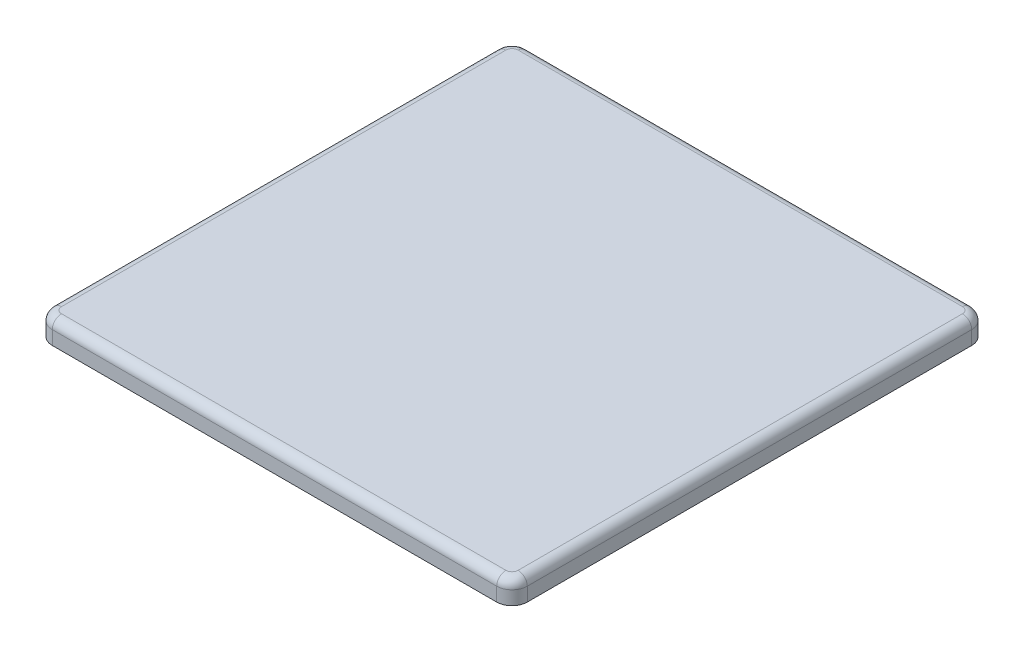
ISO-10303-21;
HEADER;
FILE_DESCRIPTION(('STEP AP214'),'2;1');
FILE_NAME('part.step','',(''),(''),'','','');
FILE_SCHEMA(('AUTOMOTIVE_DESIGN { 1 0 10303 214 1 1 1 1 }'));
ENDSEC;
DATA;
#1=APPLICATION_CONTEXT('core data for automotive mechanical design processes');
#2=APPLICATION_PROTOCOL_DEFINITION('international standard','automotive_design',2000,#1);
#3=PRODUCT_CONTEXT('',#1,'mechanical');
#4=PRODUCT('Part','Part','',(#3));
#5=PRODUCT_RELATED_PRODUCT_CATEGORY('part','',(#4));
#6=PRODUCT_DEFINITION_FORMATION('','',#4);
#7=PRODUCT_DEFINITION_CONTEXT('part definition',#1,'design');
#8=PRODUCT_DEFINITION('design','',#6,#7);
#9=PRODUCT_DEFINITION_SHAPE('','',#8);
#10=(LENGTH_UNIT() NAMED_UNIT(*) SI_UNIT(.MILLI.,.METRE.));
#11=(NAMED_UNIT(*) PLANE_ANGLE_UNIT() SI_UNIT($,.RADIAN.));
#12=(NAMED_UNIT(*) SI_UNIT($,.STERADIAN.) SOLID_ANGLE_UNIT());
#13=UNCERTAINTY_MEASURE_WITH_UNIT(LENGTH_MEASURE(1.E-05),#10,'distance_accuracy_value','');
#14=(GEOMETRIC_REPRESENTATION_CONTEXT(3) GLOBAL_UNCERTAINTY_ASSIGNED_CONTEXT((#13)) GLOBAL_UNIT_ASSIGNED_CONTEXT((#10,
#11,#12)) REPRESENTATION_CONTEXT('',''));
#15=CARTESIAN_POINT('',(0.,0.,0.));
#16=DIRECTION('',(0.,0.,1.));
#17=DIRECTION('',(1.,0.,0.));
#18=AXIS2_PLACEMENT_3D('',#15,#16,#17);
#19=CARTESIAN_POINT('',(-15.525,1.5,15.525));
#20=DIRECTION('',(1.,0.,0.));
#21=DIRECTION('',(0.,0.,-1.));
#22=AXIS2_PLACEMENT_3D('',#19,#20,#21);
#23=PLANE('',#22);
#24=DIRECTION('',(0.,-1.,0.));
#25=VECTOR('',#24,1.);
#26=CARTESIAN_POINT('',(-15.525,1.5,14.525));
#27=LINE('',#26,#25);
#28=CARTESIAN_POINT('',(-15.525,0.,14.525));
#29=VERTEX_POINT('',#28);
#30=CARTESIAN_POINT('',(-15.525,0.9,14.525));
#31=VERTEX_POINT('',#30);
#32=EDGE_CURVE('E148',#29,#31,#27,.F.);
#33=ORIENTED_EDGE('',*,*,#32,.T.);
#34=DIRECTION('',(0.,0.,1.));
#35=VECTOR('',#34,1.);
#36=CARTESIAN_POINT('',(-15.525,0.9,-14.525));
#37=LINE('',#36,#35);
#38=CARTESIAN_POINT('',(-15.525,0.9,-14.525));
#39=VERTEX_POINT('',#38);
#40=EDGE_CURVE('E143',#31,#39,#37,.F.);
#41=ORIENTED_EDGE('',*,*,#40,.T.);
#42=DIRECTION('',(0.,-1.,0.));
#43=VECTOR('',#42,1.);
#44=CARTESIAN_POINT('',(-15.525,1.5,-14.525));
#45=LINE('',#44,#43);
#46=CARTESIAN_POINT('',(-15.525,0.,-14.525));
#47=VERTEX_POINT('',#46);
#48=EDGE_CURVE('E138',#39,#47,#45,.T.);
#49=ORIENTED_EDGE('',*,*,#48,.T.);
#50=DIRECTION('',(0.,0.,1.));
#51=VECTOR('',#50,1.);
#52=CARTESIAN_POINT('',(-15.525,0.,15.525));
#53=LINE('',#52,#51);
#54=EDGE_CURVE('E141',#47,#29,#53,.T.);
#55=ORIENTED_EDGE('',*,*,#54,.T.);
#56=EDGE_LOOP('',(#33,#41,#49,#55));
#57=FACE_BOUND('',#56,.T.);
#58=ADVANCED_FACE('F47',(#57),#23,.F.);
#59=CARTESIAN_POINT('',(15.525,1.5,15.525));
#60=DIRECTION('',(0.,0.,-1.));
#61=DIRECTION('',(-1.,0.,0.));
#62=AXIS2_PLACEMENT_3D('',#59,#60,#61);
#63=PLANE('',#62);
#64=DIRECTION('',(0.,-1.,0.));
#65=VECTOR('',#64,1.);
#66=CARTESIAN_POINT('',(14.525,1.5,15.525));
#67=LINE('',#66,#65);
#68=CARTESIAN_POINT('',(14.525,0.,15.525));
#69=VERTEX_POINT('',#68);
#70=CARTESIAN_POINT('',(14.525,0.9,15.525));
#71=VERTEX_POINT('',#70);
#72=EDGE_CURVE('E195',#69,#71,#67,.F.);
#73=ORIENTED_EDGE('',*,*,#72,.T.);
#74=DIRECTION('',(1.,0.,0.));
#75=VECTOR('',#74,1.);
#76=CARTESIAN_POINT('',(-14.525,0.9,15.525));
#77=LINE('',#76,#75);
#78=CARTESIAN_POINT('',(-14.525,0.9,15.525));
#79=VERTEX_POINT('',#78);
#80=EDGE_CURVE('E70',#71,#79,#77,.F.);
#81=ORIENTED_EDGE('',*,*,#80,.T.);
#82=DIRECTION('',(0.,-1.,0.));
#83=VECTOR('',#82,1.);
#84=CARTESIAN_POINT('',(-14.525,1.5,15.525));
#85=LINE('',#84,#83);
#86=CARTESIAN_POINT('',(-14.525,0.,15.525));
#87=VERTEX_POINT('',#86);
#88=EDGE_CURVE('E193',#79,#87,#85,.T.);
#89=ORIENTED_EDGE('',*,*,#88,.T.);
#90=DIRECTION('',(1.,0.,0.));
#91=VECTOR('',#90,1.);
#92=CARTESIAN_POINT('',(15.525,0.,15.525));
#93=LINE('',#92,#91);
#94=EDGE_CURVE('E164',#87,#69,#93,.T.);
#95=ORIENTED_EDGE('',*,*,#94,.T.);
#96=EDGE_LOOP('',(#73,#81,#89,#95));
#97=FACE_BOUND('',#96,.T.);
#98=ADVANCED_FACE('F301',(#97),#63,.F.);
#99=CARTESIAN_POINT('',(15.525,1.5,15.525));
#100=DIRECTION('',(-1.,0.,0.));
#101=DIRECTION('',(0.,0.,1.));
#102=AXIS2_PLACEMENT_3D('',#99,#100,#101);
#103=PLANE('',#102);
#104=DIRECTION('',(0.,-1.,0.));
#105=VECTOR('',#104,1.);
#106=CARTESIAN_POINT('',(15.525,1.5,-14.525));
#107=LINE('',#106,#105);
#108=CARTESIAN_POINT('',(15.525,0.,-14.525));
#109=VERTEX_POINT('',#108);
#110=CARTESIAN_POINT('',(15.525,0.9,-14.525));
#111=VERTEX_POINT('',#110);
#112=EDGE_CURVE('E190',#109,#111,#107,.F.);
#113=ORIENTED_EDGE('',*,*,#112,.T.);
#114=DIRECTION('',(0.,0.,-1.));
#115=VECTOR('',#114,1.);
#116=CARTESIAN_POINT('',(15.525,0.9,14.525));
#117=LINE('',#116,#115);
#118=CARTESIAN_POINT('',(15.525,0.9,14.525));
#119=VERTEX_POINT('',#118);
#120=EDGE_CURVE('E220',#111,#119,#117,.F.);
#121=ORIENTED_EDGE('',*,*,#120,.T.);
#122=DIRECTION('',(0.,-1.,0.));
#123=VECTOR('',#122,1.);
#124=CARTESIAN_POINT('',(15.525,1.5,14.525));
#125=LINE('',#124,#123);
#126=CARTESIAN_POINT('',(15.525,0.,14.525));
#127=VERTEX_POINT('',#126);
#128=EDGE_CURVE('E188',#119,#127,#125,.T.);
#129=ORIENTED_EDGE('',*,*,#128,.T.);
#130=DIRECTION('',(0.,0.,-1.));
#131=VECTOR('',#130,1.);
#132=CARTESIAN_POINT('',(15.525,0.,15.525));
#133=LINE('',#132,#131);
#134=EDGE_CURVE('E168',#127,#109,#133,.T.);
#135=ORIENTED_EDGE('',*,*,#134,.T.);
#136=EDGE_LOOP('',(#113,#121,#129,#135));
#137=FACE_BOUND('',#136,.T.);
#138=ADVANCED_FACE('F306',(#137),#103,.F.);
#139=CARTESIAN_POINT('',(15.525,1.5,-15.525));
#140=DIRECTION('',(0.,0.,1.));
#141=DIRECTION('',(1.,0.,0.));
#142=AXIS2_PLACEMENT_3D('',#139,#140,#141);
#143=PLANE('',#142);
#144=DIRECTION('',(0.,-1.,0.));
#145=VECTOR('',#144,1.);
#146=CARTESIAN_POINT('',(-14.525,1.5,-15.525));
#147=LINE('',#146,#145);
#148=CARTESIAN_POINT('',(-14.525,0.,-15.525));
#149=VERTEX_POINT('',#148);
#150=CARTESIAN_POINT('',(-14.525,0.9,-15.525));
#151=VERTEX_POINT('',#150);
#152=EDGE_CURVE('E154',#149,#151,#147,.F.);
#153=ORIENTED_EDGE('',*,*,#152,.T.);
#154=DIRECTION('',(-1.,0.,0.));
#155=VECTOR('',#154,1.);
#156=CARTESIAN_POINT('',(14.525,0.9,-15.525));
#157=LINE('',#156,#155);
#158=CARTESIAN_POINT('',(14.525,0.9,-15.525));
#159=VERTEX_POINT('',#158);
#160=EDGE_CURVE('E216',#151,#159,#157,.F.);
#161=ORIENTED_EDGE('',*,*,#160,.T.);
#162=DIRECTION('',(0.,-1.,0.));
#163=VECTOR('',#162,1.);
#164=CARTESIAN_POINT('',(14.525,1.5,-15.525));
#165=LINE('',#164,#163);
#166=CARTESIAN_POINT('',(14.525,0.,-15.525));
#167=VERTEX_POINT('',#166);
#168=EDGE_CURVE('E158',#159,#167,#165,.T.);
#169=ORIENTED_EDGE('',*,*,#168,.T.);
#170=DIRECTION('',(-1.,0.,0.));
#171=VECTOR('',#170,1.);
#172=CARTESIAN_POINT('',(15.525,0.,-15.525));
#173=LINE('',#172,#171);
#174=EDGE_CURVE('E179',#167,#149,#173,.T.);
#175=ORIENTED_EDGE('',*,*,#174,.T.);
#176=EDGE_LOOP('',(#153,#161,#169,#175));
#177=FACE_BOUND('',#176,.T.);
#178=ADVANCED_FACE('F387',(#177),#143,.F.);
#179=CARTESIAN_POINT('',(0.,1.5,0.));
#180=DIRECTION('',(0.,1.,0.));
#181=DIRECTION('',(0.,0.,1.));
#182=AXIS2_PLACEMENT_3D('',#179,#180,#181);
#183=PLANE('',#182);
#184=DIRECTION('',(-1.,0.,0.));
#185=VECTOR('',#184,1.);
#186=CARTESIAN_POINT('',(-14.525,1.5,-14.925));
#187=LINE('',#186,#185);
#188=CARTESIAN_POINT('',(14.525,1.5,-14.925));
#189=VERTEX_POINT('',#188);
#190=CARTESIAN_POINT('',(-14.525,1.5,-14.925));
#191=VERTEX_POINT('',#190);
#192=EDGE_CURVE('E209',#189,#191,#187,.T.);
#193=ORIENTED_EDGE('',*,*,#192,.T.);
#194=CARTESIAN_POINT('',(-14.525,1.5,-14.525));
#195=DIRECTION('',(0.,1.,0.));
#196=DIRECTION('',(0.,0.,1.));
#197=AXIS2_PLACEMENT_3D('',#194,#195,#196);
#198=CIRCLE('',#197,0.4);
#199=CARTESIAN_POINT('',(-14.925,1.5,-14.525));
#200=VERTEX_POINT('',#199);
#201=EDGE_CURVE('E211',#191,#200,#198,.T.);
#202=ORIENTED_EDGE('',*,*,#201,.T.);
#203=DIRECTION('',(0.,0.,1.));
#204=VECTOR('',#203,1.);
#205=CARTESIAN_POINT('',(-14.925,1.5,14.525));
#206=LINE('',#205,#204);
#207=CARTESIAN_POINT('',(-14.925,1.5,14.525));
#208=VERTEX_POINT('',#207);
#209=EDGE_CURVE('E197',#200,#208,#206,.T.);
#210=ORIENTED_EDGE('',*,*,#209,.T.);
#211=CARTESIAN_POINT('',(-14.525,1.5,14.525));
#212=DIRECTION('',(0.,1.,0.));
#213=DIRECTION('',(0.,0.,1.));
#214=AXIS2_PLACEMENT_3D('',#211,#212,#213);
#215=CIRCLE('',#214,0.4);
#216=CARTESIAN_POINT('',(-14.525,1.5,14.925));
#217=VERTEX_POINT('',#216);
#218=EDGE_CURVE('E199',#208,#217,#215,.T.);
#219=ORIENTED_EDGE('',*,*,#218,.T.);
#220=DIRECTION('',(1.,0.,0.));
#221=VECTOR('',#220,1.);
#222=CARTESIAN_POINT('',(14.525,1.5,14.925));
#223=LINE('',#222,#221);
#224=CARTESIAN_POINT('',(14.525,1.5,14.925));
#225=VERTEX_POINT('',#224);
#226=EDGE_CURVE('E201',#217,#225,#223,.T.);
#227=ORIENTED_EDGE('',*,*,#226,.T.);
#228=CARTESIAN_POINT('',(14.525,1.5,14.525));
#229=DIRECTION('',(0.,1.,0.));
#230=DIRECTION('',(0.,0.,1.));
#231=AXIS2_PLACEMENT_3D('',#228,#229,#230);
#232=CIRCLE('',#231,0.4);
#233=CARTESIAN_POINT('',(14.925,1.5,14.525));
#234=VERTEX_POINT('',#233);
#235=EDGE_CURVE('E203',#225,#234,#232,.T.);
#236=ORIENTED_EDGE('',*,*,#235,.T.);
#237=DIRECTION('',(0.,0.,-1.));
#238=VECTOR('',#237,1.);
#239=CARTESIAN_POINT('',(14.925,1.5,-14.525));
#240=LINE('',#239,#238);
#241=CARTESIAN_POINT('',(14.925,1.5,-14.525));
#242=VERTEX_POINT('',#241);
#243=EDGE_CURVE('E205',#234,#242,#240,.T.);
#244=ORIENTED_EDGE('',*,*,#243,.T.);
#245=CARTESIAN_POINT('',(14.525,1.5,-14.525));
#246=DIRECTION('',(0.,1.,0.));
#247=DIRECTION('',(0.,0.,1.));
#248=AXIS2_PLACEMENT_3D('',#245,#246,#247);
#249=CIRCLE('',#248,0.4);
#250=EDGE_CURVE('E207',#242,#189,#249,.T.);
#251=ORIENTED_EDGE('',*,*,#250,.T.);
#252=EDGE_LOOP('',(#193,#202,#210,#219,#227,#236,#244,#251));
#253=FACE_BOUND('',#252,.T.);
#254=ADVANCED_FACE('F384',(#253),#183,.T.);
#255=CARTESIAN_POINT('',(0.,0.,0.));
#256=DIRECTION('',(0.,1.,0.));
#257=DIRECTION('',(0.,0.,1.));
#258=AXIS2_PLACEMENT_3D('',#255,#256,#257);
#259=PLANE('',#258);
#260=CARTESIAN_POINT('',(-7.525,0.,-9.02500000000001));
#261=DIRECTION('',(0.,1.,0.));
#262=DIRECTION('',(0.,0.,1.));
#263=AXIS2_PLACEMENT_3D('',#260,#261,#262);
#264=CIRCLE('',#263,3.95393920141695);
#265=CARTESIAN_POINT('',(-7.525,0.,-5.07106079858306));
#266=VERTEX_POINT('',#265);
#267=EDGE_CURVE('E11',#266,#266,#264,.T.);
#268=ORIENTED_EDGE('',*,*,#267,.T.);
#269=EDGE_LOOP('',(#268));
#270=FACE_BOUND('',#269,.T.);
#271=CARTESIAN_POINT('',(7.525,0.,-9.02500000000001));
#272=DIRECTION('',(0.,1.,0.));
#273=DIRECTION('',(0.,0.,1.));
#274=AXIS2_PLACEMENT_3D('',#271,#272,#273);
#275=CIRCLE('',#274,3.95393920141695);
#276=CARTESIAN_POINT('',(7.525,0.,-5.07106079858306));
#277=VERTEX_POINT('',#276);
#278=EDGE_CURVE('E55',#277,#277,#275,.T.);
#279=ORIENTED_EDGE('',*,*,#278,.T.);
#280=EDGE_LOOP('',(#279));
#281=FACE_BOUND('',#280,.T.);
#282=CARTESIAN_POINT('',(7.525,0.,0.));
#283=DIRECTION('',(0.,1.,0.));
#284=DIRECTION('',(0.,0.,1.));
#285=AXIS2_PLACEMENT_3D('',#282,#283,#284);
#286=CIRCLE('',#285,3.95393920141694);
#287=CARTESIAN_POINT('',(7.525,0.,3.95393920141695));
#288=VERTEX_POINT('',#287);
#289=EDGE_CURVE('E254',#288,#288,#286,.T.);
#290=ORIENTED_EDGE('',*,*,#289,.T.);
#291=EDGE_LOOP('',(#290));
#292=FACE_BOUND('',#291,.T.);
#293=CARTESIAN_POINT('',(7.525,0.,9.02500000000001));
#294=DIRECTION('',(0.,1.,0.));
#295=DIRECTION('',(0.,0.,1.));
#296=AXIS2_PLACEMENT_3D('',#293,#294,#295);
#297=CIRCLE('',#296,3.95393920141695);
#298=CARTESIAN_POINT('',(7.525,0.,12.978939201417));
#299=VERTEX_POINT('',#298);
#300=EDGE_CURVE('E251',#299,#299,#297,.T.);
#301=ORIENTED_EDGE('',*,*,#300,.T.);
#302=EDGE_LOOP('',(#301));
#303=FACE_BOUND('',#302,.T.);
#304=CARTESIAN_POINT('',(-7.525,0.,0.));
#305=DIRECTION('',(0.,1.,0.));
#306=DIRECTION('',(0.,0.,1.));
#307=AXIS2_PLACEMENT_3D('',#304,#305,#306);
#308=CIRCLE('',#307,3.95393920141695);
#309=CARTESIAN_POINT('',(-7.525,0.,3.95393920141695));
#310=VERTEX_POINT('',#309);
#311=EDGE_CURVE('E248',#310,#310,#308,.T.);
#312=ORIENTED_EDGE('',*,*,#311,.T.);
#313=EDGE_LOOP('',(#312));
#314=FACE_BOUND('',#313,.T.);
#315=CARTESIAN_POINT('',(-7.525,0.,9.02500000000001));
#316=DIRECTION('',(0.,1.,0.));
#317=DIRECTION('',(0.,0.,1.));
#318=AXIS2_PLACEMENT_3D('',#315,#316,#317);
#319=CIRCLE('',#318,3.95393920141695);
#320=CARTESIAN_POINT('',(-7.525,0.,12.978939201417));
#321=VERTEX_POINT('',#320);
#322=EDGE_CURVE('E227',#321,#321,#319,.T.);
#323=ORIENTED_EDGE('',*,*,#322,.T.);
#324=EDGE_LOOP('',(#323));
#325=FACE_BOUND('',#324,.T.);
#326=ORIENTED_EDGE('',*,*,#54,.F.);
#327=CARTESIAN_POINT('',(-14.525,0.,-14.525));
#328=DIRECTION('',(0.,1.,0.));
#329=DIRECTION('',(0.,0.,1.));
#330=AXIS2_PLACEMENT_3D('',#327,#328,#329);
#331=CIRCLE('',#330,1.);
#332=EDGE_CURVE('E151',#47,#149,#331,.F.);
#333=ORIENTED_EDGE('',*,*,#332,.T.);
#334=ORIENTED_EDGE('',*,*,#174,.F.);
#335=CARTESIAN_POINT('',(14.525,0.,-14.525));
#336=DIRECTION('',(0.,1.,0.));
#337=DIRECTION('',(0.,0.,1.));
#338=AXIS2_PLACEMENT_3D('',#335,#336,#337);
#339=CIRCLE('',#338,1.);
#340=EDGE_CURVE('E159',#167,#109,#339,.F.);
#341=ORIENTED_EDGE('',*,*,#340,.T.);
#342=ORIENTED_EDGE('',*,*,#134,.F.);
#343=CARTESIAN_POINT('',(14.525,0.,14.525));
#344=DIRECTION('',(0.,1.,0.));
#345=DIRECTION('',(0.,0.,1.));
#346=AXIS2_PLACEMENT_3D('',#343,#344,#345);
#347=CIRCLE('',#346,1.);
#348=EDGE_CURVE('E183',#127,#69,#347,.F.);
#349=ORIENTED_EDGE('',*,*,#348,.T.);
#350=ORIENTED_EDGE('',*,*,#94,.F.);
#351=CARTESIAN_POINT('',(-14.525,0.,14.525));
#352=DIRECTION('',(0.,1.,0.));
#353=DIRECTION('',(0.,0.,1.));
#354=AXIS2_PLACEMENT_3D('',#351,#352,#353);
#355=CIRCLE('',#354,1.);
#356=EDGE_CURVE('E147',#87,#29,#355,.F.);
#357=ORIENTED_EDGE('',*,*,#356,.T.);
#358=EDGE_LOOP('',(#326,#333,#334,#341,#342,#349,#350,#357));
#359=FACE_BOUND('',#358,.T.);
#360=ADVANCED_FACE('F161',(#270,#281,#292,#303,#314,#325,#359),#259,.F.);
#361=CARTESIAN_POINT('',(-14.525,1.5,-14.525));
#362=DIRECTION('',(0.,-1.,0.));
#363=DIRECTION('',(0.,0.,-1.));
#364=AXIS2_PLACEMENT_3D('',#361,#362,#363);
#365=CYLINDRICAL_SURFACE('',#364,1.);
#366=ORIENTED_EDGE('',*,*,#48,.F.);
#367=CARTESIAN_POINT('',(-14.525,0.9,-14.525));
#368=DIRECTION('',(0.,1.,0.));
#369=DIRECTION('',(0.,0.,1.));
#370=AXIS2_PLACEMENT_3D('',#367,#368,#369);
#371=CIRCLE('',#370,1.);
#372=EDGE_CURVE('E214',#39,#151,#371,.F.);
#373=ORIENTED_EDGE('',*,*,#372,.T.);
#374=ORIENTED_EDGE('',*,*,#152,.F.);
#375=ORIENTED_EDGE('',*,*,#332,.F.);
#376=EDGE_LOOP('',(#366,#373,#374,#375));
#377=FACE_BOUND('',#376,.T.);
#378=ADVANCED_FACE('F152',(#377),#365,.T.);
#379=CARTESIAN_POINT('',(14.525,1.5,-14.525));
#380=DIRECTION('',(0.,-1.,0.));
#381=DIRECTION('',(0.,0.,-1.));
#382=AXIS2_PLACEMENT_3D('',#379,#380,#381);
#383=CYLINDRICAL_SURFACE('',#382,1.);
#384=ORIENTED_EDGE('',*,*,#168,.F.);
#385=CARTESIAN_POINT('',(14.525,0.9,-14.525));
#386=DIRECTION('',(0.,1.,0.));
#387=DIRECTION('',(0.,0.,1.));
#388=AXIS2_PLACEMENT_3D('',#385,#386,#387);
#389=CIRCLE('',#388,1.);
#390=EDGE_CURVE('E218',#159,#111,#389,.F.);
#391=ORIENTED_EDGE('',*,*,#390,.T.);
#392=ORIENTED_EDGE('',*,*,#112,.F.);
#393=ORIENTED_EDGE('',*,*,#340,.F.);
#394=EDGE_LOOP('',(#384,#391,#392,#393));
#395=FACE_BOUND('',#394,.T.);
#396=ADVANCED_FACE('F312',(#395),#383,.T.);
#397=CARTESIAN_POINT('',(14.525,1.5,14.525));
#398=DIRECTION('',(0.,-1.,0.));
#399=DIRECTION('',(0.,0.,-1.));
#400=AXIS2_PLACEMENT_3D('',#397,#398,#399);
#401=CYLINDRICAL_SURFACE('',#400,1.);
#402=ORIENTED_EDGE('',*,*,#128,.F.);
#403=CARTESIAN_POINT('',(14.525,0.9,14.525));
#404=DIRECTION('',(0.,1.,0.));
#405=DIRECTION('',(0.,0.,1.));
#406=AXIS2_PLACEMENT_3D('',#403,#404,#405);
#407=CIRCLE('',#406,1.);
#408=EDGE_CURVE('E222',#119,#71,#407,.F.);
#409=ORIENTED_EDGE('',*,*,#408,.T.);
#410=ORIENTED_EDGE('',*,*,#72,.F.);
#411=ORIENTED_EDGE('',*,*,#348,.F.);
#412=EDGE_LOOP('',(#402,#409,#410,#411));
#413=FACE_BOUND('',#412,.T.);
#414=ADVANCED_FACE('F315',(#413),#401,.T.);
#415=CARTESIAN_POINT('',(-14.525,1.5,14.525));
#416=DIRECTION('',(0.,-1.,0.));
#417=DIRECTION('',(0.,0.,-1.));
#418=AXIS2_PLACEMENT_3D('',#415,#416,#417);
#419=CYLINDRICAL_SURFACE('',#418,1.);
#420=ORIENTED_EDGE('',*,*,#88,.F.);
#421=CARTESIAN_POINT('',(-14.525,0.9,14.525));
#422=DIRECTION('',(0.,1.,0.));
#423=DIRECTION('',(0.,0.,1.));
#424=AXIS2_PLACEMENT_3D('',#421,#422,#423);
#425=CIRCLE('',#424,1.);
#426=EDGE_CURVE('E62',#79,#31,#425,.F.);
#427=ORIENTED_EDGE('',*,*,#426,.T.);
#428=ORIENTED_EDGE('',*,*,#32,.F.);
#429=ORIENTED_EDGE('',*,*,#356,.F.);
#430=EDGE_LOOP('',(#420,#427,#428,#429));
#431=FACE_BOUND('',#430,.T.);
#432=ADVANCED_FACE('F319',(#431),#419,.T.);
#433=CARTESIAN_POINT('',(14.525,0.9,14.525));
#434=DIRECTION('',(0.,1.,0.));
#435=DIRECTION('',(0.,0.,1.));
#436=AXIS2_PLACEMENT_3D('',#433,#434,#435);
#437=DEGENERATE_TOROIDAL_SURFACE('',#436,0.4,0.6,.T.);
#438=CARTESIAN_POINT('',(14.525,0.9,14.925));
#439=DIRECTION('',(-1.,0.,0.));
#440=DIRECTION('',(0.,0.,1.));
#441=AXIS2_PLACEMENT_3D('',#438,#439,#440);
#442=CIRCLE('',#441,0.6);
#443=EDGE_CURVE('E171',#71,#225,#442,.T.);
#444=ORIENTED_EDGE('',*,*,#443,.F.);
#445=ORIENTED_EDGE('',*,*,#408,.F.);
#446=CARTESIAN_POINT('',(14.925,0.9,14.525));
#447=DIRECTION('',(0.,0.,-1.));
#448=DIRECTION('',(-1.,0.,0.));
#449=AXIS2_PLACEMENT_3D('',#446,#447,#448);
#450=CIRCLE('',#449,0.6);
#451=EDGE_CURVE('E165',#234,#119,#450,.T.);
#452=ORIENTED_EDGE('',*,*,#451,.F.);
#453=ORIENTED_EDGE('',*,*,#235,.F.);
#454=EDGE_LOOP('',(#444,#445,#452,#453));
#455=FACE_BOUND('',#454,.T.);
#456=ADVANCED_FACE('F323',(#455),#437,.T.);
#457=CARTESIAN_POINT('',(14.925,0.9,0.));
#458=DIRECTION('',(0.,0.,1.));
#459=DIRECTION('',(1.,0.,0.));
#460=AXIS2_PLACEMENT_3D('',#457,#458,#459);
#461=CYLINDRICAL_SURFACE('',#460,0.6);
#462=ORIENTED_EDGE('',*,*,#451,.T.);
#463=ORIENTED_EDGE('',*,*,#120,.F.);
#464=CARTESIAN_POINT('',(14.925,0.9,-14.525));
#465=DIRECTION('',(0.,0.,-1.));
#466=DIRECTION('',(-1.,0.,0.));
#467=AXIS2_PLACEMENT_3D('',#464,#465,#466);
#468=CIRCLE('',#467,0.6);
#469=EDGE_CURVE('E241',#242,#111,#468,.T.);
#470=ORIENTED_EDGE('',*,*,#469,.F.);
#471=ORIENTED_EDGE('',*,*,#243,.F.);
#472=EDGE_LOOP('',(#462,#463,#470,#471));
#473=FACE_BOUND('',#472,.T.);
#474=ADVANCED_FACE('F348',(#473),#461,.T.);
#475=CARTESIAN_POINT('',(0.,0.9,14.925));
#476=DIRECTION('',(-1.,0.,0.));
#477=DIRECTION('',(0.,0.,1.));
#478=AXIS2_PLACEMENT_3D('',#475,#476,#477);
#479=CYLINDRICAL_SURFACE('',#478,0.6);
#480=ORIENTED_EDGE('',*,*,#443,.T.);
#481=ORIENTED_EDGE('',*,*,#226,.F.);
#482=CARTESIAN_POINT('',(-14.525,0.9,14.925));
#483=DIRECTION('',(-1.,0.,0.));
#484=DIRECTION('',(0.,0.,1.));
#485=AXIS2_PLACEMENT_3D('',#482,#483,#484);
#486=CIRCLE('',#485,0.6);
#487=EDGE_CURVE('E238',#79,#217,#486,.T.);
#488=ORIENTED_EDGE('',*,*,#487,.F.);
#489=ORIENTED_EDGE('',*,*,#80,.F.);
#490=EDGE_LOOP('',(#480,#481,#488,#489));
#491=FACE_BOUND('',#490,.T.);
#492=ADVANCED_FACE('F344',(#491),#479,.T.);
#493=CARTESIAN_POINT('',(14.525,0.9,-14.525));
#494=DIRECTION('',(0.,1.,0.));
#495=DIRECTION('',(0.,0.,1.));
#496=AXIS2_PLACEMENT_3D('',#493,#494,#495);
#497=DEGENERATE_TOROIDAL_SURFACE('',#496,0.4,0.6,.T.);
#498=ORIENTED_EDGE('',*,*,#469,.T.);
#499=ORIENTED_EDGE('',*,*,#390,.F.);
#500=CARTESIAN_POINT('',(14.525,0.9,-14.925));
#501=DIRECTION('',(-1.,0.,0.));
#502=DIRECTION('',(0.,0.,1.));
#503=AXIS2_PLACEMENT_3D('',#500,#501,#502);
#504=CIRCLE('',#503,0.6);
#505=EDGE_CURVE('E235',#189,#159,#504,.T.);
#506=ORIENTED_EDGE('',*,*,#505,.F.);
#507=ORIENTED_EDGE('',*,*,#250,.F.);
#508=EDGE_LOOP('',(#498,#499,#506,#507));
#509=FACE_BOUND('',#508,.T.);
#510=ADVANCED_FACE('F340',(#509),#497,.T.);
#511=CARTESIAN_POINT('',(-14.525,0.9,14.525));
#512=DIRECTION('',(0.,1.,0.));
#513=DIRECTION('',(0.,0.,1.));
#514=AXIS2_PLACEMENT_3D('',#511,#512,#513);
#515=DEGENERATE_TOROIDAL_SURFACE('',#514,0.4,0.6,.T.);
#516=ORIENTED_EDGE('',*,*,#487,.T.);
#517=ORIENTED_EDGE('',*,*,#218,.F.);
#518=CARTESIAN_POINT('',(-14.925,0.9,14.525));
#519=DIRECTION('',(0.,0.,-1.));
#520=DIRECTION('',(-1.,0.,0.));
#521=AXIS2_PLACEMENT_3D('',#518,#519,#520);
#522=CIRCLE('',#521,0.6);
#523=EDGE_CURVE('E232',#31,#208,#522,.T.);
#524=ORIENTED_EDGE('',*,*,#523,.F.);
#525=ORIENTED_EDGE('',*,*,#426,.F.);
#526=EDGE_LOOP('',(#516,#517,#524,#525));
#527=FACE_BOUND('',#526,.T.);
#528=ADVANCED_FACE('F336',(#527),#515,.T.);
#529=CARTESIAN_POINT('',(0.,0.9,-14.925));
#530=DIRECTION('',(1.,0.,0.));
#531=DIRECTION('',(0.,0.,-1.));
#532=AXIS2_PLACEMENT_3D('',#529,#530,#531);
#533=CYLINDRICAL_SURFACE('',#532,0.6);
#534=ORIENTED_EDGE('',*,*,#505,.T.);
#535=ORIENTED_EDGE('',*,*,#160,.F.);
#536=CARTESIAN_POINT('',(-14.525,0.9,-14.925));
#537=DIRECTION('',(-1.,0.,0.));
#538=DIRECTION('',(0.,0.,1.));
#539=AXIS2_PLACEMENT_3D('',#536,#537,#538);
#540=CIRCLE('',#539,0.6);
#541=EDGE_CURVE('E230',#191,#151,#540,.T.);
#542=ORIENTED_EDGE('',*,*,#541,.F.);
#543=ORIENTED_EDGE('',*,*,#192,.F.);
#544=EDGE_LOOP('',(#534,#535,#542,#543));
#545=FACE_BOUND('',#544,.T.);
#546=ADVANCED_FACE('F332',(#545),#533,.T.);
#547=CARTESIAN_POINT('',(-14.925,0.9,0.));
#548=DIRECTION('',(0.,0.,-1.));
#549=DIRECTION('',(-1.,0.,0.));
#550=AXIS2_PLACEMENT_3D('',#547,#548,#549);
#551=CYLINDRICAL_SURFACE('',#550,0.6);
#552=ORIENTED_EDGE('',*,*,#523,.T.);
#553=ORIENTED_EDGE('',*,*,#209,.F.);
#554=CARTESIAN_POINT('',(-14.925,0.9,-14.525));
#555=DIRECTION('',(0.,0.,-1.));
#556=DIRECTION('',(-1.,0.,0.));
#557=AXIS2_PLACEMENT_3D('',#554,#555,#556);
#558=CIRCLE('',#557,0.6);
#559=EDGE_CURVE('E228',#39,#200,#558,.T.);
#560=ORIENTED_EDGE('',*,*,#559,.F.);
#561=ORIENTED_EDGE('',*,*,#40,.F.);
#562=EDGE_LOOP('',(#552,#553,#560,#561));
#563=FACE_BOUND('',#562,.T.);
#564=ADVANCED_FACE('F328',(#563),#551,.T.);
#565=CARTESIAN_POINT('',(-14.525,0.9,-14.525));
#566=DIRECTION('',(0.,1.,0.));
#567=DIRECTION('',(0.,0.,1.));
#568=AXIS2_PLACEMENT_3D('',#565,#566,#567);
#569=DEGENERATE_TOROIDAL_SURFACE('',#568,0.4,0.6,.T.);
#570=ORIENTED_EDGE('',*,*,#541,.T.);
#571=ORIENTED_EDGE('',*,*,#372,.F.);
#572=ORIENTED_EDGE('',*,*,#559,.T.);
#573=ORIENTED_EDGE('',*,*,#201,.F.);
#574=EDGE_LOOP('',(#570,#571,#572,#573));
#575=FACE_BOUND('',#574,.T.);
#576=ADVANCED_FACE('F324',(#575),#569,.T.);
#577=CARTESIAN_POINT('',(-7.525,0.7,9.02500000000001));
#578=DIRECTION('',(0.,-1.,0.));
#579=DIRECTION('',(0.,0.,-1.));
#580=AXIS2_PLACEMENT_3D('',#577,#578,#579);
#581=PLANE('',#580);
#582=CARTESIAN_POINT('',(-7.525,0.7,9.02500000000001));
#583=DIRECTION('',(0.,-1.,0.));
#584=DIRECTION('',(0.,0.,-1.));
#585=AXIS2_PLACEMENT_3D('',#582,#583,#584);
#586=CIRCLE('',#585,3.);
#587=CARTESIAN_POINT('',(-7.525,0.7,6.025));
#588=VERTEX_POINT('',#587);
#589=EDGE_CURVE('E174',#588,#588,#586,.T.);
#590=ORIENTED_EDGE('',*,*,#589,.T.);
#591=EDGE_LOOP('',(#590));
#592=FACE_BOUND('',#591,.T.);
#593=ADVANCED_FACE('F327',(#592),#581,.T.);
#594=CARTESIAN_POINT('',(7.525,0.7,0.));
#595=DIRECTION('',(0.,1.,0.));
#596=DIRECTION('',(0.,0.,1.));
#597=AXIS2_PLACEMENT_3D('',#594,#595,#596);
#598=PLANE('',#597);
#599=CARTESIAN_POINT('',(7.525,0.7,0.));
#600=DIRECTION('',(0.,-1.,0.));
#601=DIRECTION('',(0.,0.,1.));
#602=AXIS2_PLACEMENT_3D('',#599,#600,#601);
#603=CIRCLE('',#602,3.);
#604=CARTESIAN_POINT('',(7.525,0.7,3.));
#605=VERTEX_POINT('',#604);
#606=EDGE_CURVE('E281',#605,#605,#603,.T.);
#607=ORIENTED_EDGE('',*,*,#606,.T.);
#608=EDGE_LOOP('',(#607));
#609=FACE_BOUND('',#608,.T.);
#610=ADVANCED_FACE('F287',(#609),#598,.F.);
#611=CARTESIAN_POINT('',(-7.525,0.7,0.));
#612=DIRECTION('',(0.,-1.,0.));
#613=DIRECTION('',(0.,0.,-1.));
#614=AXIS2_PLACEMENT_3D('',#611,#612,#613);
#615=PLANE('',#614);
#616=CARTESIAN_POINT('',(-7.525,0.7,0.));
#617=DIRECTION('',(0.,-1.,0.));
#618=DIRECTION('',(0.,0.,-1.));
#619=AXIS2_PLACEMENT_3D('',#616,#617,#618);
#620=CIRCLE('',#619,3.);
#621=CARTESIAN_POINT('',(-7.525,0.7,-3.));
#622=VERTEX_POINT('',#621);
#623=EDGE_CURVE('E277',#622,#622,#620,.T.);
#624=ORIENTED_EDGE('',*,*,#623,.T.);
#625=EDGE_LOOP('',(#624));
#626=FACE_BOUND('',#625,.T.);
#627=ADVANCED_FACE('F372',(#626),#615,.T.);
#628=CARTESIAN_POINT('',(-7.525,0.7,-9.02500000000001));
#629=DIRECTION('',(0.,1.,0.));
#630=DIRECTION('',(0.,0.,1.));
#631=AXIS2_PLACEMENT_3D('',#628,#629,#630);
#632=PLANE('',#631);
#633=CARTESIAN_POINT('',(-7.525,0.7,-9.02500000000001));
#634=DIRECTION('',(0.,-1.,0.));
#635=DIRECTION('',(0.,0.,1.));
#636=AXIS2_PLACEMENT_3D('',#633,#634,#635);
#637=CIRCLE('',#636,3.);
#638=CARTESIAN_POINT('',(-7.525,0.7,-6.025));
#639=VERTEX_POINT('',#638);
#640=EDGE_CURVE('E272',#639,#639,#637,.T.);
#641=ORIENTED_EDGE('',*,*,#640,.T.);
#642=EDGE_LOOP('',(#641));
#643=FACE_BOUND('',#642,.T.);
#644=ADVANCED_FACE('F370',(#643),#632,.F.);
#645=CARTESIAN_POINT('',(7.525,0.7,-9.02500000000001));
#646=DIRECTION('',(0.,-1.,0.));
#647=DIRECTION('',(0.,0.,-1.));
#648=AXIS2_PLACEMENT_3D('',#645,#646,#647);
#649=PLANE('',#648);
#650=CARTESIAN_POINT('',(7.525,0.7,-9.02500000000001));
#651=DIRECTION('',(0.,-1.,0.));
#652=DIRECTION('',(0.,0.,-1.));
#653=AXIS2_PLACEMENT_3D('',#650,#651,#652);
#654=CIRCLE('',#653,3.);
#655=CARTESIAN_POINT('',(7.525,0.7,-12.025));
#656=VERTEX_POINT('',#655);
#657=EDGE_CURVE('E269',#656,#656,#654,.T.);
#658=ORIENTED_EDGE('',*,*,#657,.T.);
#659=EDGE_LOOP('',(#658));
#660=FACE_BOUND('',#659,.T.);
#661=ADVANCED_FACE('F363',(#660),#649,.T.);
#662=CARTESIAN_POINT('',(7.525,0.7,9.02500000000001));
#663=DIRECTION('',(0.,1.,0.));
#664=DIRECTION('',(0.,0.,1.));
#665=AXIS2_PLACEMENT_3D('',#662,#663,#664);
#666=PLANE('',#665);
#667=CARTESIAN_POINT('',(7.525,0.7,9.02500000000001));
#668=DIRECTION('',(0.,-1.,0.));
#669=DIRECTION('',(0.,0.,1.));
#670=AXIS2_PLACEMENT_3D('',#667,#668,#669);
#671=CIRCLE('',#670,3.);
#672=CARTESIAN_POINT('',(7.525,0.7,12.025));
#673=VERTEX_POINT('',#672);
#674=EDGE_CURVE('E271',#673,#673,#671,.T.);
#675=ORIENTED_EDGE('',*,*,#674,.T.);
#676=EDGE_LOOP('',(#675));
#677=FACE_BOUND('',#676,.T.);
#678=ADVANCED_FACE('F357',(#677),#666,.F.);
#679=CARTESIAN_POINT('',(-7.525,1.,-9.02500000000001));
#680=DIRECTION('',(0.,1.,0.));
#681=DIRECTION('',(0.,0.,1.));
#682=AXIS2_PLACEMENT_3D('',#679,#680,#681);
#683=TOROIDAL_SURFACE('',#682,3.95393920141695,1.);
#684=ORIENTED_EDGE('',*,*,#267,.F.);
#685=EDGE_LOOP('',(#684));
#686=FACE_BOUND('',#685,.T.);
#687=ORIENTED_EDGE('',*,*,#640,.F.);
#688=EDGE_LOOP('',(#687));
#689=FACE_BOUND('',#688,.T.);
#690=ADVANCED_FACE('F265',(#686,#689),#683,.T.);
#691=CARTESIAN_POINT('',(7.525,1.,-9.02500000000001));
#692=DIRECTION('',(0.,1.,0.));
#693=DIRECTION('',(0.,0.,1.));
#694=AXIS2_PLACEMENT_3D('',#691,#692,#693);
#695=TOROIDAL_SURFACE('',#694,3.95393920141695,1.);
#696=ORIENTED_EDGE('',*,*,#278,.F.);
#697=EDGE_LOOP('',(#696));
#698=FACE_BOUND('',#697,.T.);
#699=ORIENTED_EDGE('',*,*,#657,.F.);
#700=EDGE_LOOP('',(#699));
#701=FACE_BOUND('',#700,.T.);
#702=ADVANCED_FACE('F261',(#698,#701),#695,.T.);
#703=CARTESIAN_POINT('',(7.525,1.,0.));
#704=DIRECTION('',(0.,1.,0.));
#705=DIRECTION('',(0.,0.,1.));
#706=AXIS2_PLACEMENT_3D('',#703,#704,#705);
#707=TOROIDAL_SURFACE('',#706,3.95393920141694,1.);
#708=ORIENTED_EDGE('',*,*,#289,.F.);
#709=EDGE_LOOP('',(#708));
#710=FACE_BOUND('',#709,.T.);
#711=ORIENTED_EDGE('',*,*,#606,.F.);
#712=EDGE_LOOP('',(#711));
#713=FACE_BOUND('',#712,.T.);
#714=ADVANCED_FACE('F264',(#710,#713),#707,.T.);
#715=CARTESIAN_POINT('',(7.525,1.,9.02500000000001));
#716=DIRECTION('',(0.,1.,0.));
#717=DIRECTION('',(0.,0.,1.));
#718=AXIS2_PLACEMENT_3D('',#715,#716,#717);
#719=TOROIDAL_SURFACE('',#718,3.95393920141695,1.);
#720=ORIENTED_EDGE('',*,*,#300,.F.);
#721=EDGE_LOOP('',(#720));
#722=FACE_BOUND('',#721,.T.);
#723=ORIENTED_EDGE('',*,*,#674,.F.);
#724=EDGE_LOOP('',(#723));
#725=FACE_BOUND('',#724,.T.);
#726=ADVANCED_FACE('F290',(#722,#725),#719,.T.);
#727=CARTESIAN_POINT('',(-7.525,1.,0.));
#728=DIRECTION('',(0.,1.,0.));
#729=DIRECTION('',(0.,0.,1.));
#730=AXIS2_PLACEMENT_3D('',#727,#728,#729);
#731=TOROIDAL_SURFACE('',#730,3.95393920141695,1.);
#732=ORIENTED_EDGE('',*,*,#311,.F.);
#733=EDGE_LOOP('',(#732));
#734=FACE_BOUND('',#733,.T.);
#735=ORIENTED_EDGE('',*,*,#623,.F.);
#736=EDGE_LOOP('',(#735));
#737=FACE_BOUND('',#736,.T.);
#738=ADVANCED_FACE('F296',(#734,#737),#731,.T.);
#739=CARTESIAN_POINT('',(-7.525,1.,9.02500000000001));
#740=DIRECTION('',(0.,1.,0.));
#741=DIRECTION('',(0.,0.,1.));
#742=AXIS2_PLACEMENT_3D('',#739,#740,#741);
#743=TOROIDAL_SURFACE('',#742,3.95393920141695,1.);
#744=ORIENTED_EDGE('',*,*,#322,.F.);
#745=EDGE_LOOP('',(#744));
#746=FACE_BOUND('',#745,.T.);
#747=ORIENTED_EDGE('',*,*,#589,.F.);
#748=EDGE_LOOP('',(#747));
#749=FACE_BOUND('',#748,.T.);
#750=ADVANCED_FACE('F49',(#746,#749),#743,.T.);
#751=CLOSED_SHELL('',(#58,#98,#138,#178,#254,#360,#378,#396,#414,#432,#456,#474,#492,#510,#528,
#546,#564,#576,#593,#610,#627,#644,#661,#678,#690,#702,#714,#726,#738,#750));
#752=MANIFOLD_SOLID_BREP('B2',#751);
#753=ADVANCED_BREP_SHAPE_REPRESENTATION('',(#18,#752),#14);
#754=SHAPE_DEFINITION_REPRESENTATION(#9,#753);
ENDSEC;
END-ISO-10303-21;
